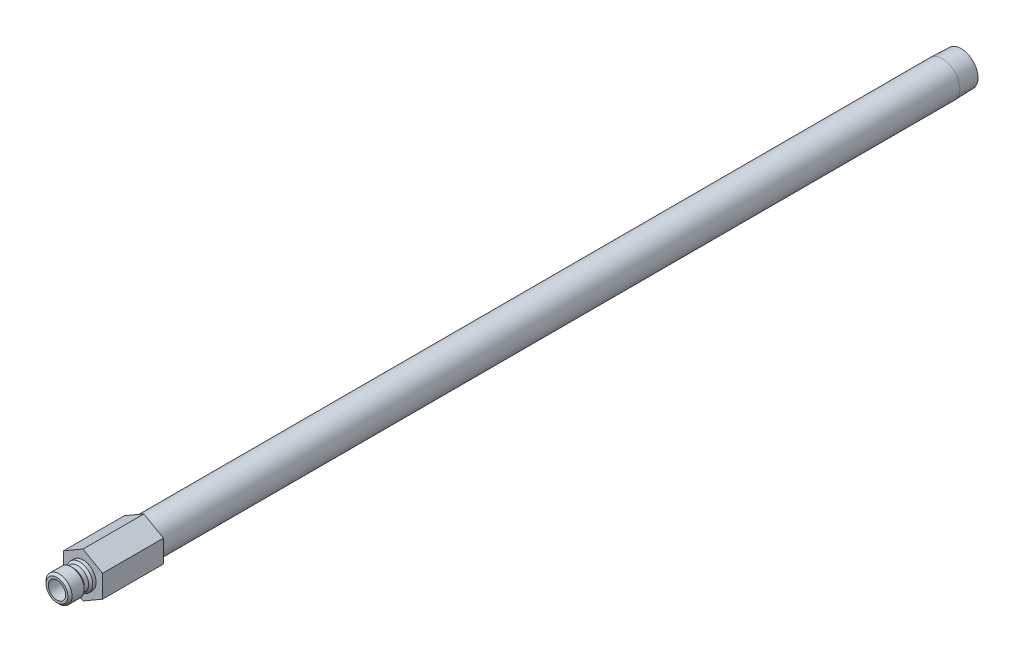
from build123d import *

# Parameters (mm, degrees)
SKETCH2_R           = 3.175
BOSS_EXTRUDE1_DEPTH = 22.225


with BuildPart() as part:
    # Sketch1 → Revolve1 (revolve)
    with BuildSketch(Plane(origin=(0, 0, 0), x_dir=(0, 0, -1), z_dir=(1, 0, 0))):
        Polygon((-9.525, 3.175), (-9.525, 4.0005), (-8.763, 4.7625), (-4.318, 4.7625), (-3.556, 4.0005), (-1.9685, 4.0005), (-1.2065, 4.7625), (0, 4.7625), (0, 6.35), (313.817, 6.35), (320.675, 6.135688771), (320.675, 4.6228), (22.225, 4.6228), (22.225, 3.175), align=None)
    revolve(axis=Axis((0, 0, 0), (0, 0, 1)))

    # Sketch2 → Boss-Extrude1 (add)
    with BuildSketch(Plane.XY):
        Polygon((-7.112, 4.106115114), (-7.112, -4.106115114), (0, -8.212230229), (7.112, -4.106115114), (7.112, 4.106115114), (0, 8.212230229), align=None)
        with Locations(Location((0, 0, 0), (0, 0, 90))):
            Circle(SKETCH2_R, mode=Mode.SUBTRACT)
    extrude(amount=-BOSS_EXTRUDE1_DEPTH)


solid = part.part
